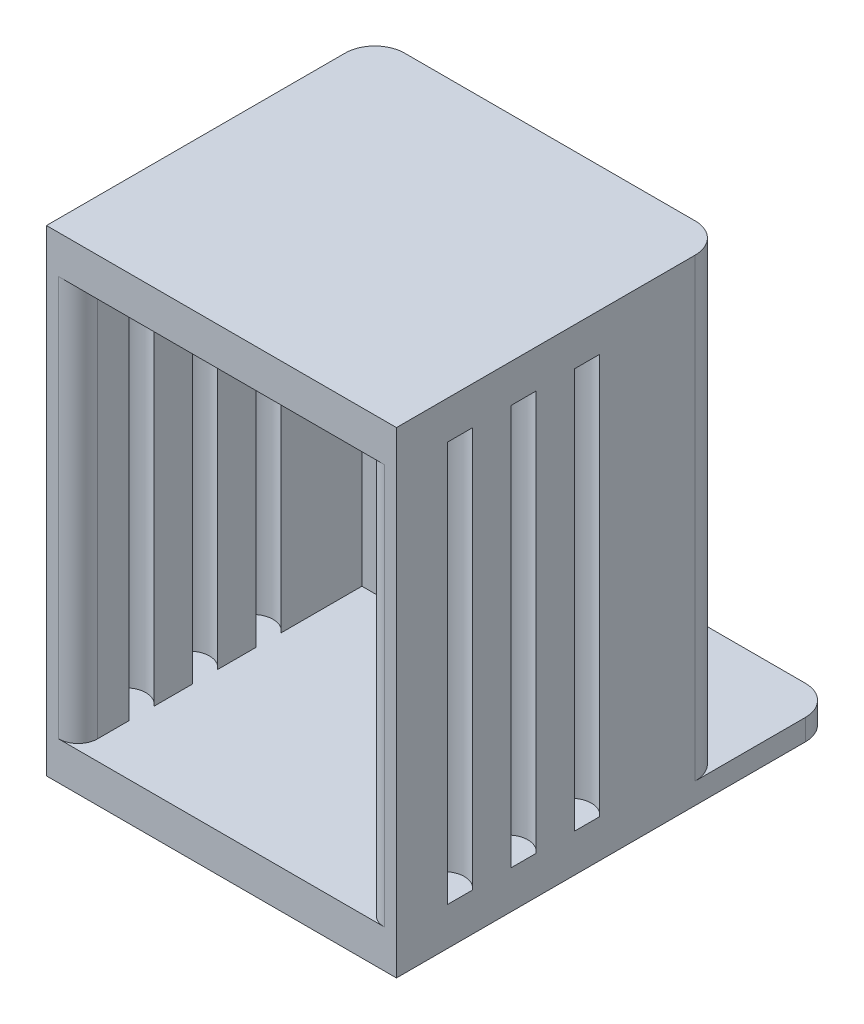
from build123d import *

# Parameters (mm, degrees)
SKETCH1_W          = 20.9804
SKETCH1_H          = 19.685
EXTRUDE1_DEPTH     = 28.575
SKETCH2_W          = 17.1958
SKETCH2_H          = 24.003
CUT_EXTRUDE1_DEPTH = 17.018
SKETCH3_W          = 20.9804
SKETCH3_H          = 6.604
EXTRUDE2_DEPTH     = 1.27
FILLET1_R          = 1.778
SKETCH4_R          = 1.2065
CUT_EXTRUDE2_DEPTH = 12.0015
FILLET2_R          = 1.778
FILLET3_R          = 1.1684


with BuildPart() as part:
    # Sketch1 → Extrude1 (new body)
    with BuildSketch(Plane(origin=(0, 0, 0), x_dir=(1, 0, 0), z_dir=(0, 1, 0))):
        with Locations((0, 9.8425)):
            Rectangle(SKETCH1_W, SKETCH1_H)
    extrude(amount=EXTRUDE1_DEPTH)

    # Sketch2 → Cut-Extrude1 (cut)
    with BuildSketch(Plane.XY):
        with Locations((0, 14.2875)):
            Rectangle(SKETCH2_W, SKETCH2_H)
    extrude(amount=-CUT_EXTRUDE1_DEPTH, mode=Mode.SUBTRACT)

    # Sketch3 → Extrude2 (add)
    with BuildSketch(Plane.XZ):
        with Locations((0, -22.987)):
            Rectangle(SKETCH3_W, SKETCH3_H)
    extrude(amount=-EXTRUDE2_DEPTH)

    # Fillet1
    fillet1_edges = [part.edges().sort_by_distance(p)[0] for p in [
        (-10.4902, 14.9225, -19.685),
        (10.4902, 14.9225, -19.685),
    ]]
    fillet(fillet1_edges, radius=FILLET1_R)

    # Sketch4 → Cut-Extrude2 (cut, symmetric)
    with BuildSketch(Plane(origin=(0, 14.2875, 0), x_dir=(-1, 0, 0), z_dir=(0, 1, 0))):
        with Locations((-9.54405, -3.81)):
            Circle(SKETCH4_R)
        with Locations((-9.54405, -7.62)):
            Circle(SKETCH4_R)
        with Locations((-9.54405, -11.43)):
            Circle(SKETCH4_R)
    cut_extrude2 = extrude(amount=CUT_EXTRUDE2_DEPTH, both=True, mode=Mode.SUBTRACT)

    # Mirror1: Cut-Extrude2 across plane
    add(cut_extrude2.mirror(Plane(origin=(0, 0, 0), x_dir=(0, 0, 1), z_dir=(1, 0, 0))), mode=Mode.SUBTRACT)

    # Fillet2
    fillet2_edges = [part.edges().sort_by_distance(p)[0] for p in [
        (-10.4902, 0.635, -26.289),
        (10.4902, 0.635, -26.289),
    ]]
    fillet(fillet2_edges, radius=FILLET2_R)

    # Fillet3
    fillet3_edges = [part.edges().sort_by_distance(p)[0] for p in [
        (-8.5979, 14.2875, 0),
        (8.5979, 14.2875, 0),
    ]]
    fillet(fillet3_edges, radius=FILLET3_R)


solid = part.part
